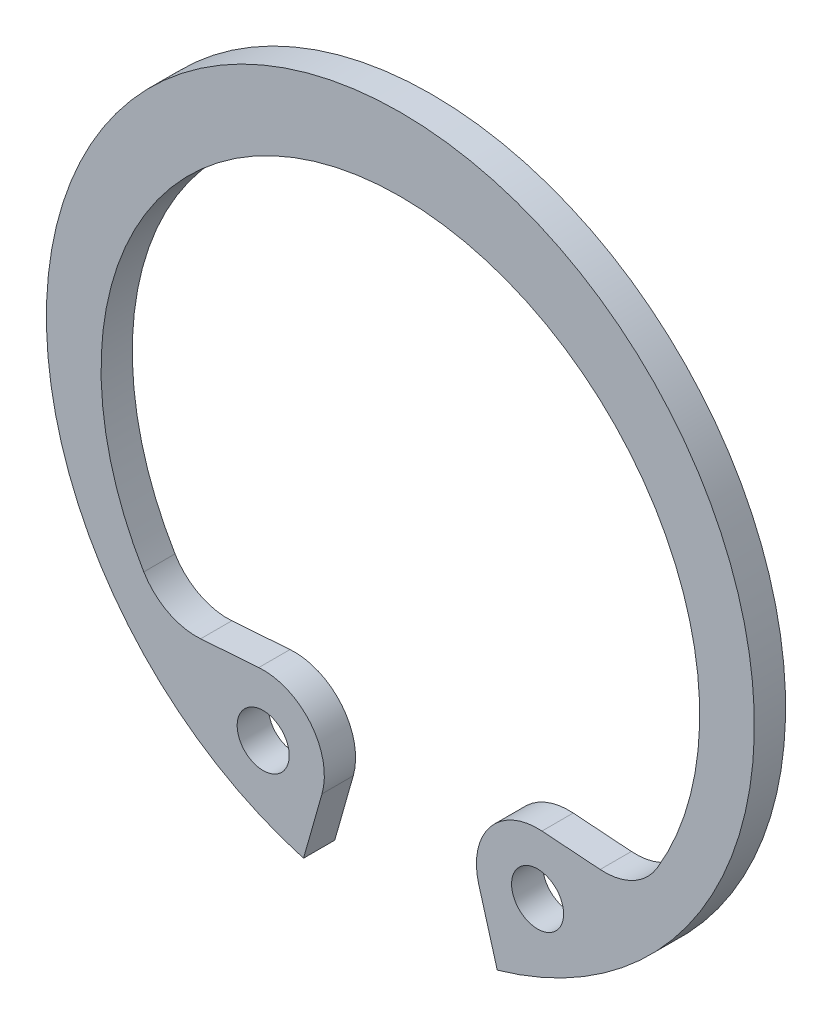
ISO-10303-21;
HEADER;
FILE_DESCRIPTION(('STEP AP214'),'2;1');
FILE_NAME('part.step','',(''),(''),'','','');
FILE_SCHEMA(('AUTOMOTIVE_DESIGN { 1 0 10303 214 1 1 1 1 }'));
ENDSEC;
DATA;
#1=APPLICATION_CONTEXT('core data for automotive mechanical design processes');
#2=APPLICATION_PROTOCOL_DEFINITION('international standard','automotive_design',2000,#1);
#3=PRODUCT_CONTEXT('',#1,'mechanical');
#4=PRODUCT('Part','Part','',(#3));
#5=PRODUCT_RELATED_PRODUCT_CATEGORY('part','',(#4));
#6=PRODUCT_DEFINITION_FORMATION('','',#4);
#7=PRODUCT_DEFINITION_CONTEXT('part definition',#1,'design');
#8=PRODUCT_DEFINITION('design','',#6,#7);
#9=PRODUCT_DEFINITION_SHAPE('','',#8);
#10=(LENGTH_UNIT() NAMED_UNIT(*) SI_UNIT(.MILLI.,.METRE.));
#11=(NAMED_UNIT(*) PLANE_ANGLE_UNIT() SI_UNIT($,.RADIAN.));
#12=(NAMED_UNIT(*) SI_UNIT($,.STERADIAN.) SOLID_ANGLE_UNIT());
#13=UNCERTAINTY_MEASURE_WITH_UNIT(LENGTH_MEASURE(1.E-05),#10,'distance_accuracy_value','');
#14=(GEOMETRIC_REPRESENTATION_CONTEXT(3) GLOBAL_UNCERTAINTY_ASSIGNED_CONTEXT((#13)) GLOBAL_UNIT_ASSIGNED_CONTEXT((#10,
#11,#12)) REPRESENTATION_CONTEXT('',''));
#15=CARTESIAN_POINT('',(0.,0.,0.));
#16=DIRECTION('',(0.,0.,1.));
#17=DIRECTION('',(1.,0.,0.));
#18=AXIS2_PLACEMENT_3D('',#15,#16,#17);
#19=CARTESIAN_POINT('',(0.,0.,1.2));
#20=DIRECTION('',(0.,0.,1.));
#21=DIRECTION('',(1.,0.,0.));
#22=AXIS2_PLACEMENT_3D('',#19,#20,#21);
#23=PLANE('',#22);
#24=CARTESIAN_POINT('',(5.27108068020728,-9.93872267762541,1.2));
#25=DIRECTION('',(0.,0.,1.));
#26=DIRECTION('',(1.,0.,0.));
#27=AXIS2_PLACEMENT_3D('',#24,#25,#26);
#28=CIRCLE('',#27,1.);
#29=CARTESIAN_POINT('',(6.27108068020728,-9.93872267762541,1.2));
#30=VERTEX_POINT('',#29);
#31=EDGE_CURVE('E124',#30,#30,#28,.T.);
#32=ORIENTED_EDGE('',*,*,#31,.F.);
#33=EDGE_LOOP('',(#32));
#34=FACE_BOUND('',#33,.T.);
#35=CARTESIAN_POINT('',(0.,0.,1.2));
#36=DIRECTION('',(0.,0.,1.));
#37=DIRECTION('',(1.,0.,0.));
#38=AXIS2_PLACEMENT_3D('',#35,#36,#37);
#39=CIRCLE('',#38,13.6);
#40=CARTESIAN_POINT('',(3.72181666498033,-13.0808287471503,1.2));
#41=VERTEX_POINT('',#40);
#42=CARTESIAN_POINT('',(-3.72181666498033,-13.0808287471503,1.2));
#43=VERTEX_POINT('',#42);
#44=EDGE_CURVE('E146',#41,#43,#39,.T.);
#45=ORIENTED_EDGE('',*,*,#44,.T.);
#46=DIRECTION('',(0.273662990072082,0.961825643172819,0.));
#47=VECTOR('',#46,1.);
#48=CARTESIAN_POINT('',(-3.01079041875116,-10.5818307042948,1.2));
#49=LINE('',#48,#47);
#50=CARTESIAN_POINT('',(-3.01079041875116,-10.5818307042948,1.2));
#51=VERTEX_POINT('',#50);
#52=EDGE_CURVE('E119',#43,#51,#49,.T.);
#53=ORIENTED_EDGE('',*,*,#52,.T.);
#54=CARTESIAN_POINT('',(-5.27108068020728,-9.93872267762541,1.2));
#55=DIRECTION('',(0.,0.,1.));
#56=DIRECTION('',(-1.,0.,0.));
#57=AXIS2_PLACEMENT_3D('',#54,#55,#56);
#58=CIRCLE('',#57,2.35);
#59=CARTESIAN_POINT('',(-5.43982161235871,-7.59478869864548,1.2));
#60=VERTEX_POINT('',#59);
#61=EDGE_CURVE('E149',#51,#60,#58,.T.);
#62=ORIENTED_EDGE('',*,*,#61,.T.);
#63=DIRECTION('',(-0.997418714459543,-0.0718046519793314,0.));
#64=VECTOR('',#63,1.);
#65=CARTESIAN_POINT('',(-7.67484642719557,-7.75568920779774,1.2));
#66=LINE('',#65,#64);
#67=CARTESIAN_POINT('',(-7.67484642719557,-7.75568920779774,1.2));
#68=VERTEX_POINT('',#67);
#69=EDGE_CURVE('E151',#60,#68,#66,.T.);
#70=ORIENTED_EDGE('',*,*,#69,.T.);
#71=CARTESIAN_POINT('',(-7.843587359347,-5.41175522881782,1.2));
#72=DIRECTION('',(0.,0.,-1.));
#73=DIRECTION('',(-1.,0.,0.));
#74=AXIS2_PLACEMENT_3D('',#71,#72,#73);
#75=CIRCLE('',#74,2.35);
#76=CARTESIAN_POINT('',(-9.85806061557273,-6.62187815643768,1.2));
#77=VERTEX_POINT('',#76);
#78=EDGE_CURVE('E153',#68,#77,#75,.T.);
#79=ORIENTED_EDGE('',*,*,#78,.T.);
#80=CARTESIAN_POINT('',(0.,-0.7,1.2));
#81=DIRECTION('',(0.,0.,-1.));
#82=DIRECTION('',(1.,0.,0.));
#83=AXIS2_PLACEMENT_3D('',#80,#81,#82);
#84=CIRCLE('',#83,11.5);
#85=CARTESIAN_POINT('',(9.85806061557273,-6.62187815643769,1.2));
#86=VERTEX_POINT('',#85);
#87=EDGE_CURVE('E155',#77,#86,#84,.T.);
#88=ORIENTED_EDGE('',*,*,#87,.T.);
#89=CARTESIAN_POINT('',(7.843587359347,-5.41175522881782,1.2));
#90=DIRECTION('',(0.,0.,-1.));
#91=DIRECTION('',(1.,0.,0.));
#92=AXIS2_PLACEMENT_3D('',#89,#90,#91);
#93=CIRCLE('',#92,2.35);
#94=CARTESIAN_POINT('',(7.67484642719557,-7.75568920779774,1.2));
#95=VERTEX_POINT('',#94);
#96=EDGE_CURVE('E157',#86,#95,#93,.T.);
#97=ORIENTED_EDGE('',*,*,#96,.T.);
#98=DIRECTION('',(-0.997418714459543,0.0718046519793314,0.));
#99=VECTOR('',#98,1.);
#100=CARTESIAN_POINT('',(7.67484642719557,-7.75568920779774,1.2));
#101=LINE('',#100,#99);
#102=CARTESIAN_POINT('',(5.43982161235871,-7.59478869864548,1.2));
#103=VERTEX_POINT('',#102);
#104=EDGE_CURVE('E159',#95,#103,#101,.T.);
#105=ORIENTED_EDGE('',*,*,#104,.T.);
#106=CARTESIAN_POINT('',(5.27108068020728,-9.93872267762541,1.2));
#107=DIRECTION('',(0.,0.,1.));
#108=DIRECTION('',(1.,0.,0.));
#109=AXIS2_PLACEMENT_3D('',#106,#107,#108);
#110=CIRCLE('',#109,2.35);
#111=CARTESIAN_POINT('',(3.01079041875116,-10.5818307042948,1.2));
#112=VERTEX_POINT('',#111);
#113=EDGE_CURVE('E48',#103,#112,#110,.T.);
#114=ORIENTED_EDGE('',*,*,#113,.T.);
#115=DIRECTION('',(0.273662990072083,-0.961825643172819,0.));
#116=VECTOR('',#115,1.);
#117=CARTESIAN_POINT('',(3.01079041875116,-10.5818307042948,1.2));
#118=LINE('',#117,#116);
#119=EDGE_CURVE('E43',#112,#41,#118,.T.);
#120=ORIENTED_EDGE('',*,*,#119,.T.);
#121=EDGE_LOOP('',(#45,#53,#62,#70,#79,#88,#97,#105,#114,#120));
#122=FACE_BOUND('',#121,.T.);
#123=CARTESIAN_POINT('',(-5.27108068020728,-9.93872267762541,1.2));
#124=DIRECTION('',(0.,0.,1.));
#125=DIRECTION('',(-1.,0.,0.));
#126=AXIS2_PLACEMENT_3D('',#123,#124,#125);
#127=CIRCLE('',#126,1.);
#128=CARTESIAN_POINT('',(-6.27108068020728,-9.93872267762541,1.2));
#129=VERTEX_POINT('',#128);
#130=EDGE_CURVE('E246',#129,#129,#127,.T.);
#131=ORIENTED_EDGE('',*,*,#130,.F.);
#132=EDGE_LOOP('',(#131));
#133=FACE_BOUND('',#132,.T.);
#134=ADVANCED_FACE('F28',(#34,#122,#133),#23,.T.);
#135=CARTESIAN_POINT('',(0.,0.,0.));
#136=DIRECTION('',(0.,0.,1.));
#137=DIRECTION('',(1.,0.,0.));
#138=AXIS2_PLACEMENT_3D('',#135,#136,#137);
#139=PLANE('',#138);
#140=CARTESIAN_POINT('',(5.27108068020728,-9.93872267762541,0.));
#141=DIRECTION('',(0.,0.,1.));
#142=DIRECTION('',(1.,0.,0.));
#143=AXIS2_PLACEMENT_3D('',#140,#141,#142);
#144=CIRCLE('',#143,1.);
#145=CARTESIAN_POINT('',(6.27108068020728,-9.93872267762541,0.));
#146=VERTEX_POINT('',#145);
#147=EDGE_CURVE('E127',#146,#146,#144,.T.);
#148=ORIENTED_EDGE('',*,*,#147,.T.);
#149=EDGE_LOOP('',(#148));
#150=FACE_BOUND('',#149,.T.);
#151=CARTESIAN_POINT('',(0.,0.,0.));
#152=DIRECTION('',(0.,0.,1.));
#153=DIRECTION('',(1.,0.,0.));
#154=AXIS2_PLACEMENT_3D('',#151,#152,#153);
#155=CIRCLE('',#154,13.6);
#156=CARTESIAN_POINT('',(3.72181666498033,-13.0808287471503,0.));
#157=VERTEX_POINT('',#156);
#158=CARTESIAN_POINT('',(-3.72181666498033,-13.0808287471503,0.));
#159=VERTEX_POINT('',#158);
#160=EDGE_CURVE('E110',#157,#159,#155,.T.);
#161=ORIENTED_EDGE('',*,*,#160,.F.);
#162=DIRECTION('',(0.273662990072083,-0.961825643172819,0.));
#163=VECTOR('',#162,1.);
#164=CARTESIAN_POINT('',(3.01079041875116,-10.5818307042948,0.));
#165=LINE('',#164,#163);
#166=CARTESIAN_POINT('',(3.01079041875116,-10.5818307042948,0.));
#167=VERTEX_POINT('',#166);
#168=EDGE_CURVE('E144',#167,#157,#165,.T.);
#169=ORIENTED_EDGE('',*,*,#168,.F.);
#170=CARTESIAN_POINT('',(5.27108068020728,-9.93872267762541,0.));
#171=DIRECTION('',(0.,0.,1.));
#172=DIRECTION('',(1.,0.,0.));
#173=AXIS2_PLACEMENT_3D('',#170,#171,#172);
#174=CIRCLE('',#173,2.35);
#175=CARTESIAN_POINT('',(5.43982161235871,-7.59478869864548,0.));
#176=VERTEX_POINT('',#175);
#177=EDGE_CURVE('E142',#176,#167,#174,.T.);
#178=ORIENTED_EDGE('',*,*,#177,.F.);
#179=DIRECTION('',(-0.997418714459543,0.0718046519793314,0.));
#180=VECTOR('',#179,1.);
#181=CARTESIAN_POINT('',(7.67484642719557,-7.75568920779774,0.));
#182=LINE('',#181,#180);
#183=CARTESIAN_POINT('',(7.67484642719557,-7.75568920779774,0.));
#184=VERTEX_POINT('',#183);
#185=EDGE_CURVE('E140',#184,#176,#182,.T.);
#186=ORIENTED_EDGE('',*,*,#185,.F.);
#187=CARTESIAN_POINT('',(7.843587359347,-5.41175522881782,0.));
#188=DIRECTION('',(0.,0.,-1.));
#189=DIRECTION('',(1.,0.,0.));
#190=AXIS2_PLACEMENT_3D('',#187,#188,#189);
#191=CIRCLE('',#190,2.35);
#192=CARTESIAN_POINT('',(9.85806061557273,-6.62187815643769,0.));
#193=VERTEX_POINT('',#192);
#194=EDGE_CURVE('E138',#193,#184,#191,.T.);
#195=ORIENTED_EDGE('',*,*,#194,.F.);
#196=CARTESIAN_POINT('',(0.,-0.7,0.));
#197=DIRECTION('',(0.,0.,-1.));
#198=DIRECTION('',(1.,0.,0.));
#199=AXIS2_PLACEMENT_3D('',#196,#197,#198);
#200=CIRCLE('',#199,11.5);
#201=CARTESIAN_POINT('',(-9.85806061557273,-6.62187815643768,0.));
#202=VERTEX_POINT('',#201);
#203=EDGE_CURVE('E136',#202,#193,#200,.T.);
#204=ORIENTED_EDGE('',*,*,#203,.F.);
#205=CARTESIAN_POINT('',(-7.843587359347,-5.41175522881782,0.));
#206=DIRECTION('',(0.,0.,-1.));
#207=DIRECTION('',(-1.,0.,0.));
#208=AXIS2_PLACEMENT_3D('',#205,#206,#207);
#209=CIRCLE('',#208,2.35);
#210=CARTESIAN_POINT('',(-7.67484642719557,-7.75568920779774,0.));
#211=VERTEX_POINT('',#210);
#212=EDGE_CURVE('E134',#211,#202,#209,.T.);
#213=ORIENTED_EDGE('',*,*,#212,.F.);
#214=DIRECTION('',(-0.997418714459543,-0.0718046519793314,0.));
#215=VECTOR('',#214,1.);
#216=CARTESIAN_POINT('',(-7.67484642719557,-7.75568920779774,0.));
#217=LINE('',#216,#215);
#218=CARTESIAN_POINT('',(-5.43982161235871,-7.59478869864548,0.));
#219=VERTEX_POINT('',#218);
#220=EDGE_CURVE('E132',#219,#211,#217,.T.);
#221=ORIENTED_EDGE('',*,*,#220,.F.);
#222=CARTESIAN_POINT('',(-5.27108068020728,-9.93872267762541,0.));
#223=DIRECTION('',(0.,0.,1.));
#224=DIRECTION('',(-1.,0.,0.));
#225=AXIS2_PLACEMENT_3D('',#222,#223,#224);
#226=CIRCLE('',#225,2.35);
#227=CARTESIAN_POINT('',(-3.01079041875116,-10.5818307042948,0.));
#228=VERTEX_POINT('',#227);
#229=EDGE_CURVE('E112',#228,#219,#226,.T.);
#230=ORIENTED_EDGE('',*,*,#229,.F.);
#231=DIRECTION('',(0.273662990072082,0.961825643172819,0.));
#232=VECTOR('',#231,1.);
#233=CARTESIAN_POINT('',(-3.01079041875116,-10.5818307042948,0.));
#234=LINE('',#233,#232);
#235=EDGE_CURVE('E105',#159,#228,#234,.T.);
#236=ORIENTED_EDGE('',*,*,#235,.F.);
#237=EDGE_LOOP('',(#161,#169,#178,#186,#195,#204,#213,#221,#230,#236));
#238=FACE_BOUND('',#237,.T.);
#239=CARTESIAN_POINT('',(-5.27108068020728,-9.93872267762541,0.));
#240=DIRECTION('',(0.,0.,1.));
#241=DIRECTION('',(-1.,0.,0.));
#242=AXIS2_PLACEMENT_3D('',#239,#240,#241);
#243=CIRCLE('',#242,1.);
#244=CARTESIAN_POINT('',(-6.27108068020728,-9.93872267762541,0.));
#245=VERTEX_POINT('',#244);
#246=EDGE_CURVE('E249',#245,#245,#243,.T.);
#247=ORIENTED_EDGE('',*,*,#246,.T.);
#248=EDGE_LOOP('',(#247));
#249=FACE_BOUND('',#248,.T.);
#250=ADVANCED_FACE('F106',(#150,#238,#249),#139,.F.);
#251=CARTESIAN_POINT('',(0.,0.,1.2));
#252=DIRECTION('',(0.,0.,-1.));
#253=DIRECTION('',(-1.,0.,0.));
#254=AXIS2_PLACEMENT_3D('',#251,#252,#253);
#255=CYLINDRICAL_SURFACE('',#254,13.6);
#256=ORIENTED_EDGE('',*,*,#160,.T.);
#257=DIRECTION('',(0.,0.,-1.));
#258=VECTOR('',#257,1.);
#259=CARTESIAN_POINT('',(-3.72181666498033,-13.0808287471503,1.2));
#260=LINE('',#259,#258);
#261=EDGE_CURVE('E11',#43,#159,#260,.T.);
#262=ORIENTED_EDGE('',*,*,#261,.F.);
#263=ORIENTED_EDGE('',*,*,#44,.F.);
#264=DIRECTION('',(0.,0.,-1.));
#265=VECTOR('',#264,1.);
#266=CARTESIAN_POINT('',(3.72181666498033,-13.0808287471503,1.2));
#267=LINE('',#266,#265);
#268=EDGE_CURVE('E123',#41,#157,#267,.T.);
#269=ORIENTED_EDGE('',*,*,#268,.T.);
#270=EDGE_LOOP('',(#256,#262,#263,#269));
#271=FACE_BOUND('',#270,.T.);
#272=ADVANCED_FACE('F30',(#271),#255,.T.);
#273=CARTESIAN_POINT('',(-3.01079041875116,-10.5818307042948,1.2));
#274=DIRECTION('',(-0.961825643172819,0.273662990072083,0.));
#275=DIRECTION('',(-0.273662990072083,-0.961825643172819,0.));
#276=AXIS2_PLACEMENT_3D('',#273,#274,#275);
#277=PLANE('',#276);
#278=ORIENTED_EDGE('',*,*,#235,.T.);
#279=DIRECTION('',(0.,0.,-1.));
#280=VECTOR('',#279,1.);
#281=CARTESIAN_POINT('',(-3.01079041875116,-10.5818307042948,1.2));
#282=LINE('',#281,#280);
#283=EDGE_CURVE('E36',#51,#228,#282,.T.);
#284=ORIENTED_EDGE('',*,*,#283,.F.);
#285=ORIENTED_EDGE('',*,*,#52,.F.);
#286=ORIENTED_EDGE('',*,*,#261,.T.);
#287=EDGE_LOOP('',(#278,#284,#285,#286));
#288=FACE_BOUND('',#287,.T.);
#289=ADVANCED_FACE('F118',(#288),#277,.F.);
#290=CARTESIAN_POINT('',(-5.27108068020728,-9.93872267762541,1.2));
#291=DIRECTION('',(0.,0.,-1.));
#292=DIRECTION('',(-1.,0.,0.));
#293=AXIS2_PLACEMENT_3D('',#290,#291,#292);
#294=CYLINDRICAL_SURFACE('',#293,2.35);
#295=ORIENTED_EDGE('',*,*,#229,.T.);
#296=DIRECTION('',(0.,0.,-1.));
#297=VECTOR('',#296,1.);
#298=CARTESIAN_POINT('',(-5.43982161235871,-7.59478869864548,1.2));
#299=LINE('',#298,#297);
#300=EDGE_CURVE('E182',#60,#219,#299,.T.);
#301=ORIENTED_EDGE('',*,*,#300,.F.);
#302=ORIENTED_EDGE('',*,*,#61,.F.);
#303=ORIENTED_EDGE('',*,*,#283,.T.);
#304=EDGE_LOOP('',(#295,#301,#302,#303));
#305=FACE_BOUND('',#304,.T.);
#306=ADVANCED_FACE('F186',(#305),#294,.T.);
#307=CARTESIAN_POINT('',(-7.67484642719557,-7.75568920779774,1.2));
#308=DIRECTION('',(0.0718046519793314,-0.997418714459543,0.));
#309=DIRECTION('',(0.997418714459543,0.0718046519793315,0.));
#310=AXIS2_PLACEMENT_3D('',#307,#308,#309);
#311=PLANE('',#310);
#312=ORIENTED_EDGE('',*,*,#220,.T.);
#313=DIRECTION('',(0.,0.,-1.));
#314=VECTOR('',#313,1.);
#315=CARTESIAN_POINT('',(-7.67484642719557,-7.75568920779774,1.2));
#316=LINE('',#315,#314);
#317=EDGE_CURVE('E179',#68,#211,#316,.T.);
#318=ORIENTED_EDGE('',*,*,#317,.F.);
#319=ORIENTED_EDGE('',*,*,#69,.F.);
#320=ORIENTED_EDGE('',*,*,#300,.T.);
#321=EDGE_LOOP('',(#312,#318,#319,#320));
#322=FACE_BOUND('',#321,.T.);
#323=ADVANCED_FACE('F194',(#322),#311,.F.);
#324=CARTESIAN_POINT('',(-7.843587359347,-5.41175522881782,1.2));
#325=DIRECTION('',(0.,0.,-1.));
#326=DIRECTION('',(-1.,0.,0.));
#327=AXIS2_PLACEMENT_3D('',#324,#325,#326);
#328=CYLINDRICAL_SURFACE('',#327,2.35);
#329=ORIENTED_EDGE('',*,*,#212,.T.);
#330=DIRECTION('',(0.,0.,-1.));
#331=VECTOR('',#330,1.);
#332=CARTESIAN_POINT('',(-9.85806061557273,-6.62187815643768,1.2));
#333=LINE('',#332,#331);
#334=EDGE_CURVE('E176',#77,#202,#333,.T.);
#335=ORIENTED_EDGE('',*,*,#334,.F.);
#336=ORIENTED_EDGE('',*,*,#78,.F.);
#337=ORIENTED_EDGE('',*,*,#317,.T.);
#338=EDGE_LOOP('',(#329,#335,#336,#337));
#339=FACE_BOUND('',#338,.T.);
#340=ADVANCED_FACE('F197',(#339),#328,.F.);
#341=CARTESIAN_POINT('',(0.,-0.7,1.2));
#342=DIRECTION('',(0.,0.,-1.));
#343=DIRECTION('',(-1.,0.,0.));
#344=AXIS2_PLACEMENT_3D('',#341,#342,#343);
#345=CYLINDRICAL_SURFACE('',#344,11.5);
#346=ORIENTED_EDGE('',*,*,#203,.T.);
#347=DIRECTION('',(0.,0.,-1.));
#348=VECTOR('',#347,1.);
#349=CARTESIAN_POINT('',(9.85806061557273,-6.62187815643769,1.2));
#350=LINE('',#349,#348);
#351=EDGE_CURVE('E173',#86,#193,#350,.T.);
#352=ORIENTED_EDGE('',*,*,#351,.F.);
#353=ORIENTED_EDGE('',*,*,#87,.F.);
#354=ORIENTED_EDGE('',*,*,#334,.T.);
#355=EDGE_LOOP('',(#346,#352,#353,#354));
#356=FACE_BOUND('',#355,.T.);
#357=ADVANCED_FACE('F202',(#356),#345,.F.);
#358=CARTESIAN_POINT('',(7.843587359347,-5.41175522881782,1.2));
#359=DIRECTION('',(0.,0.,-1.));
#360=DIRECTION('',(-1.,0.,0.));
#361=AXIS2_PLACEMENT_3D('',#358,#359,#360);
#362=CYLINDRICAL_SURFACE('',#361,2.35);
#363=ORIENTED_EDGE('',*,*,#194,.T.);
#364=DIRECTION('',(0.,0.,-1.));
#365=VECTOR('',#364,1.);
#366=CARTESIAN_POINT('',(7.67484642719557,-7.75568920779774,1.2));
#367=LINE('',#366,#365);
#368=EDGE_CURVE('E170',#95,#184,#367,.T.);
#369=ORIENTED_EDGE('',*,*,#368,.F.);
#370=ORIENTED_EDGE('',*,*,#96,.F.);
#371=ORIENTED_EDGE('',*,*,#351,.T.);
#372=EDGE_LOOP('',(#363,#369,#370,#371));
#373=FACE_BOUND('',#372,.T.);
#374=ADVANCED_FACE('F208',(#373),#362,.F.);
#375=CARTESIAN_POINT('',(7.67484642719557,-7.75568920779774,1.2));
#376=DIRECTION('',(-0.0718046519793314,-0.997418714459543,0.));
#377=DIRECTION('',(0.997418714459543,-0.0718046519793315,0.));
#378=AXIS2_PLACEMENT_3D('',#375,#376,#377);
#379=PLANE('',#378);
#380=ORIENTED_EDGE('',*,*,#185,.T.);
#381=DIRECTION('',(0.,0.,-1.));
#382=VECTOR('',#381,1.);
#383=CARTESIAN_POINT('',(5.43982161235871,-7.59478869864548,1.2));
#384=LINE('',#383,#382);
#385=EDGE_CURVE('E167',#103,#176,#384,.T.);
#386=ORIENTED_EDGE('',*,*,#385,.F.);
#387=ORIENTED_EDGE('',*,*,#104,.F.);
#388=ORIENTED_EDGE('',*,*,#368,.T.);
#389=EDGE_LOOP('',(#380,#386,#387,#388));
#390=FACE_BOUND('',#389,.T.);
#391=ADVANCED_FACE('F212',(#390),#379,.F.);
#392=CARTESIAN_POINT('',(5.27108068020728,-9.93872267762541,1.2));
#393=DIRECTION('',(0.,0.,-1.));
#394=DIRECTION('',(-1.,0.,0.));
#395=AXIS2_PLACEMENT_3D('',#392,#393,#394);
#396=CYLINDRICAL_SURFACE('',#395,2.35);
#397=ORIENTED_EDGE('',*,*,#177,.T.);
#398=DIRECTION('',(0.,0.,-1.));
#399=VECTOR('',#398,1.);
#400=CARTESIAN_POINT('',(3.01079041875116,-10.5818307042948,1.2));
#401=LINE('',#400,#399);
#402=EDGE_CURVE('E164',#112,#167,#401,.T.);
#403=ORIENTED_EDGE('',*,*,#402,.F.);
#404=ORIENTED_EDGE('',*,*,#113,.F.);
#405=ORIENTED_EDGE('',*,*,#385,.T.);
#406=EDGE_LOOP('',(#397,#403,#404,#405));
#407=FACE_BOUND('',#406,.T.);
#408=ADVANCED_FACE('F215',(#407),#396,.T.);
#409=CARTESIAN_POINT('',(3.01079041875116,-10.5818307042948,1.2));
#410=DIRECTION('',(0.961825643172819,0.273662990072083,0.));
#411=DIRECTION('',(-0.273662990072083,0.961825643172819,0.));
#412=AXIS2_PLACEMENT_3D('',#409,#410,#411);
#413=PLANE('',#412);
#414=ORIENTED_EDGE('',*,*,#168,.T.);
#415=ORIENTED_EDGE('',*,*,#268,.F.);
#416=ORIENTED_EDGE('',*,*,#119,.F.);
#417=ORIENTED_EDGE('',*,*,#402,.T.);
#418=EDGE_LOOP('',(#414,#415,#416,#417));
#419=FACE_BOUND('',#418,.T.);
#420=ADVANCED_FACE('F217',(#419),#413,.F.);
#421=CARTESIAN_POINT('',(5.27108068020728,-9.93872267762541,1.2));
#422=DIRECTION('',(0.,0.,-1.));
#423=DIRECTION('',(-1.,0.,0.));
#424=AXIS2_PLACEMENT_3D('',#421,#422,#423);
#425=CYLINDRICAL_SURFACE('',#424,1.);
#426=ORIENTED_EDGE('',*,*,#31,.T.);
#427=EDGE_LOOP('',(#426));
#428=FACE_BOUND('',#427,.T.);
#429=ORIENTED_EDGE('',*,*,#147,.F.);
#430=EDGE_LOOP('',(#429));
#431=FACE_BOUND('',#430,.T.);
#432=ADVANCED_FACE('F219',(#428,#431),#425,.F.);
#433=CARTESIAN_POINT('',(-5.27108068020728,-9.93872267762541,1.2));
#434=DIRECTION('',(0.,0.,-1.));
#435=DIRECTION('',(-1.,0.,0.));
#436=AXIS2_PLACEMENT_3D('',#433,#434,#435);
#437=CYLINDRICAL_SURFACE('',#436,1.);
#438=ORIENTED_EDGE('',*,*,#130,.T.);
#439=EDGE_LOOP('',(#438));
#440=FACE_BOUND('',#439,.T.);
#441=ORIENTED_EDGE('',*,*,#246,.F.);
#442=EDGE_LOOP('',(#441));
#443=FACE_BOUND('',#442,.T.);
#444=ADVANCED_FACE('F225',(#440,#443),#437,.F.);
#445=CLOSED_SHELL('',(#134,#250,#272,#289,#306,#323,#340,#357,#374,#391,#408,#420,#432,#444));
#446=MANIFOLD_SOLID_BREP('B2',#445);
#447=ADVANCED_BREP_SHAPE_REPRESENTATION('',(#18,#446),#14);
#448=SHAPE_DEFINITION_REPRESENTATION(#9,#447);
ENDSEC;
END-ISO-10303-21;
